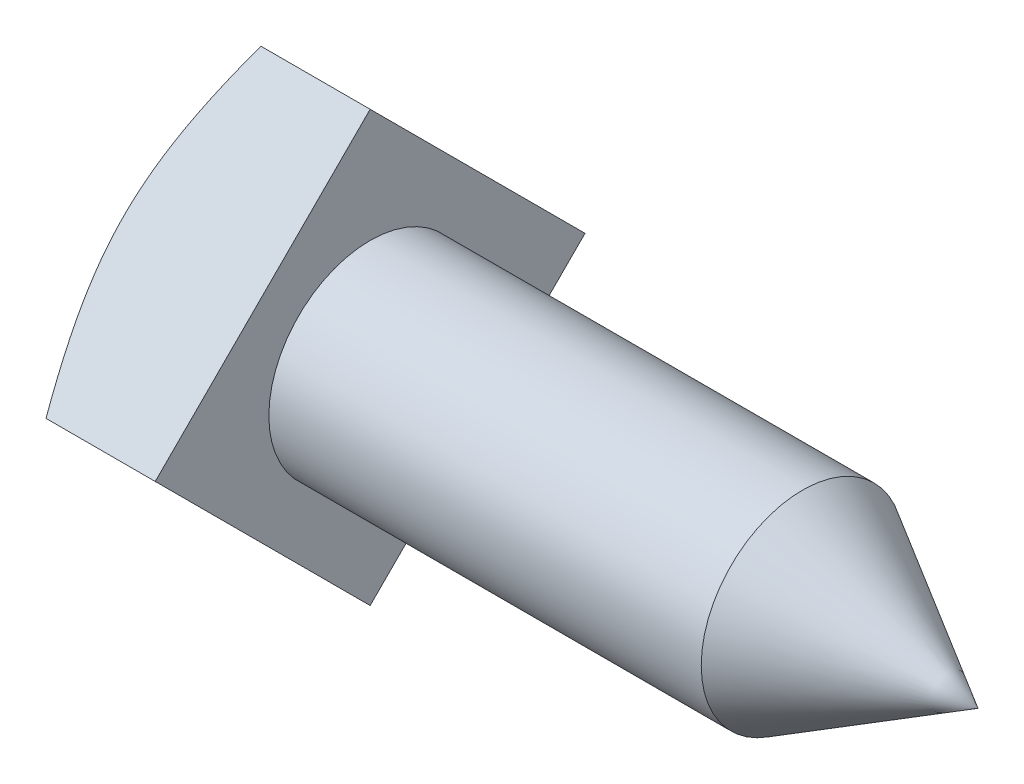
ISO-10303-21;
HEADER;
FILE_DESCRIPTION(('STEP AP214'),'2;1');
FILE_NAME('part.step','',(''),(''),'','','');
FILE_SCHEMA(('AUTOMOTIVE_DESIGN { 1 0 10303 214 1 1 1 1 }'));
ENDSEC;
DATA;
#1=APPLICATION_CONTEXT('core data for automotive mechanical design processes');
#2=APPLICATION_PROTOCOL_DEFINITION('international standard','automotive_design',2000,#1);
#3=PRODUCT_CONTEXT('',#1,'mechanical');
#4=PRODUCT('Part','Part','',(#3));
#5=PRODUCT_RELATED_PRODUCT_CATEGORY('part','',(#4));
#6=PRODUCT_DEFINITION_FORMATION('','',#4);
#7=PRODUCT_DEFINITION_CONTEXT('part definition',#1,'design');
#8=PRODUCT_DEFINITION('design','',#6,#7);
#9=PRODUCT_DEFINITION_SHAPE('','',#8);
#10=(LENGTH_UNIT() NAMED_UNIT(*) SI_UNIT(.MILLI.,.METRE.));
#11=(NAMED_UNIT(*) PLANE_ANGLE_UNIT() SI_UNIT($,.RADIAN.));
#12=(NAMED_UNIT(*) SI_UNIT($,.STERADIAN.) SOLID_ANGLE_UNIT());
#13=UNCERTAINTY_MEASURE_WITH_UNIT(LENGTH_MEASURE(1.E-05),#10,'distance_accuracy_value','');
#14=(GEOMETRIC_REPRESENTATION_CONTEXT(3) GLOBAL_UNCERTAINTY_ASSIGNED_CONTEXT((#13)) GLOBAL_UNIT_ASSIGNED_CONTEXT((#10,
#11,#12)) REPRESENTATION_CONTEXT('',''));
#15=CARTESIAN_POINT('',(0.,0.,0.));
#16=DIRECTION('',(0.,0.,1.));
#17=DIRECTION('',(1.,0.,0.));
#18=AXIS2_PLACEMENT_3D('',#15,#16,#17);
#19=CARTESIAN_POINT('',(17.3736,0.,-26.9407683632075));
#20=DIRECTION('',(0.,-0.707106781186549,0.707106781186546));
#21=DIRECTION('',(0.,-0.707106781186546,-0.707106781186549));
#22=AXIS2_PLACEMENT_3D('',#19,#20,#21);
#23=PLANE('',#22);
#24=CARTESIAN_POINT('',(3.67961897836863,26.9409683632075,0.000200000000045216));
#25=CARTESIAN_POINT('',(3.5548106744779,26.6733023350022,-0.267466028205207));
#26=CARTESIAN_POINT('',(3.43166591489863,26.4052457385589,-0.53552262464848));
#27=CARTESIAN_POINT('',(3.1890899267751,25.8682845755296,-1.0724837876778));
#28=CARTESIAN_POINT('',(3.06965881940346,25.599379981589,-1.34138838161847));
#29=CARTESIAN_POINT('',(2.83485734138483,25.0605646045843,-1.88020375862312));
#30=CARTESIAN_POINT('',(2.71948863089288,24.7906534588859,-2.15011490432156));
#31=CARTESIAN_POINT('',(2.49331484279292,24.2498808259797,-2.69088753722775));
#32=CARTESIAN_POINT('',(2.38250972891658,23.9790193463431,-2.96174901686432));
#33=CARTESIAN_POINT('',(2.05612530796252,23.1610744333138,-3.77969392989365));
#34=CARTESIAN_POINT('',(1.84824930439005,22.6124346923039,-4.32833367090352));
#35=CARTESIAN_POINT('',(1.45758123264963,21.5107337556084,-5.43003460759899));
#36=CARTESIAN_POINT('',(1.27478662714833,20.9576730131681,-5.9830953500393));
#37=CARTESIAN_POINT('',(0.945511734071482,19.8664326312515,-7.07433573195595));
#38=CARTESIAN_POINT('',(0.797980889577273,19.3284131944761,-7.61235516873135));
#39=CARTESIAN_POINT('',(0.536422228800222,18.2482773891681,-8.69249097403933));
#40=CARTESIAN_POINT('',(0.422394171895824,17.7061610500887,-9.23460731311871));
#41=CARTESIAN_POINT('',(0.233146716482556,16.6203771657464,-10.3203911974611));
#42=CARTESIAN_POINT('',(0.157794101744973,16.0767215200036,-10.8640468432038));
#43=CARTESIAN_POINT('',(0.0762638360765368,15.2597076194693,-11.6810607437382));
#44=CARTESIAN_POINT('',(0.0543365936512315,14.9871029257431,-11.9536654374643));
#45=CARTESIAN_POINT('',(0.0212582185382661,14.4415698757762,-12.4991984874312));
#46=CARTESIAN_POINT('',(0.0101066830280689,14.1686415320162,-12.7721268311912));
#47=CARTESIAN_POINT('',(-0.00161011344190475,13.605599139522,-13.3351692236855));
#48=CARTESIAN_POINT('',(-0.00146976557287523,13.3154776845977,-13.6252906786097));
#49=CARTESIAN_POINT('',(0.0111599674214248,12.7353688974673,-14.2053994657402));
#50=CARTESIAN_POINT('',(0.0236494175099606,12.4453815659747,-14.4953867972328));
#51=CARTESIAN_POINT('',(0.06078024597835,11.8657903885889,-15.0749779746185));
#52=CARTESIAN_POINT('',(0.085421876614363,11.5761865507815,-15.364581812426));
#53=CARTESIAN_POINT('',(0.146470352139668,10.9975953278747,-15.9431730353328));
#54=CARTESIAN_POINT('',(0.182877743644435,10.7086079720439,-16.2321603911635));
#55=CARTESIAN_POINT('',(0.309293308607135,9.84074831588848,-17.100020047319));
#56=CARTESIAN_POINT('',(0.416353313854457,9.26308735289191,-17.6776810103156));
#57=CARTESIAN_POINT('',(0.670258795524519,8.11225138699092,-18.8285169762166));
#58=CARTESIAN_POINT('',(0.817104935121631,7.53907645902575,-19.4016919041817));
#59=CARTESIAN_POINT('',(1.15063001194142,6.37560138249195,-20.5651669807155));
#60=CARTESIAN_POINT('',(1.33862518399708,5.78549181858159,-21.1552765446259));
#61=CARTESIAN_POINT('',(1.74416737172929,4.61034109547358,-22.3304272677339));
#62=CARTESIAN_POINT('',(1.96171822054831,4.0253006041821,-22.9154677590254));
#63=CARTESIAN_POINT('',(2.30502412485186,3.15351567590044,-23.7872526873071));
#64=CARTESIAN_POINT('',(2.42180887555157,2.86498021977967,-24.0757881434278));
#65=CARTESIAN_POINT('',(2.66065189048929,2.28899759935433,-24.6517707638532));
#66=CARTESIAN_POINT('',(2.78271020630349,2.00155044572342,-24.9392179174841));
#67=CARTESIAN_POINT('',(3.03148171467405,1.42782962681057,-25.5129387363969));
#68=CARTESIAN_POINT('',(3.15819248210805,1.14155543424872,-25.7992129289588));
#69=CARTESIAN_POINT('',(3.41584794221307,0.569973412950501,-26.370794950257));
#70=CARTESIAN_POINT('',(3.54679246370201,0.284665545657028,-26.6561028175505));
#71=CARTESIAN_POINT('',(3.67961897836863,-0.000199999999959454,-26.9409683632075));
#72=B_SPLINE_CURVE_WITH_KNOTS('',3,(#24,#25,#26,#27,#28,#29,#30,#31,#32,#33,#34,#35,#36,#37,#38,
#39,#40,#41,#42,#43,#44,#45,#46,#47,#48,#49,#50,#51,#52,#53,#54,#55,#56,#57,#58,#59,#60,#61,#62,
#63,#64,#65,#66,#67,#68,#69,#70,#71),.UNSPECIFIED.,.F.,.F.,(4,2,2,2,2,2,2,2,2,2,2,2,2,2,2,2,2,2,
2,2,2,2,2,4),(0.,1.19574621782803,2.39153141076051,3.5877997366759,4.78405855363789,
7.1934730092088,9.60264353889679,11.9271362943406,14.2516123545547,16.5680271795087,
17.726333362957,18.8845962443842,20.1152898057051,21.3459898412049,22.5767154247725,
23.8074981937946,26.2780083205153,28.7485596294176,31.3142561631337,33.8802857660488,
35.1535601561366,36.4268470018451,37.6994793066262,38.9720602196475),.UNSPECIFIED.);
#73=CARTESIAN_POINT('',(3.67952571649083,26.9407683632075,0.));
#74=VERTEX_POINT('',#73);
#75=CARTESIAN_POINT('',(0.,13.4703841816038,-13.4703841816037));
#76=VERTEX_POINT('',#75);
#77=EDGE_CURVE('E105',#74,#76,#72,.T.);
#78=ORIENTED_EDGE('',*,*,#77,.F.);
#79=DIRECTION('',(-1.,0.,0.));
#80=VECTOR('',#79,1.);
#81=CARTESIAN_POINT('',(17.3736,26.9407683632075,0.));
#82=LINE('',#81,#80);
#83=CARTESIAN_POINT('',(17.3736,26.9407683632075,0.));
#84=VERTEX_POINT('',#83);
#85=EDGE_CURVE('E115',#84,#74,#82,.T.);
#86=ORIENTED_EDGE('',*,*,#85,.F.);
#87=DIRECTION('',(0.,0.707106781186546,0.707106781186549));
#88=VECTOR('',#87,1.);
#89=CARTESIAN_POINT('',(17.3736,0.,-26.9407683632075));
#90=LINE('',#89,#88);
#91=CARTESIAN_POINT('',(17.3736,0.,-26.9407683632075));
#92=VERTEX_POINT('',#91);
#93=EDGE_CURVE('E118',#92,#84,#90,.T.);
#94=ORIENTED_EDGE('',*,*,#93,.F.);
#95=DIRECTION('',(-1.,0.,0.));
#96=VECTOR('',#95,1.);
#97=CARTESIAN_POINT('',(17.3736,0.,-26.9407683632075));
#98=LINE('',#97,#96);
#99=CARTESIAN_POINT('',(3.67952571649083,0.,-26.9407683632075));
#100=VERTEX_POINT('',#99);
#101=EDGE_CURVE('E181',#92,#100,#98,.T.);
#102=ORIENTED_EDGE('',*,*,#101,.T.);
#103=EDGE_CURVE('E54',#76,#100,#72,.T.);
#104=ORIENTED_EDGE('',*,*,#103,.F.);
#105=EDGE_LOOP('',(#78,#86,#94,#102,#104));
#106=FACE_BOUND('',#105,.T.);
#107=ADVANCED_FACE('F33',(#106),#23,.F.);
#108=CARTESIAN_POINT('',(17.3736,0.,26.9407683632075));
#109=DIRECTION('',(0.,0.707106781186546,0.707106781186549));
#110=DIRECTION('',(0.,-0.707106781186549,0.707106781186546));
#111=AXIS2_PLACEMENT_3D('',#108,#109,#110);
#112=PLANE('',#111);
#113=ORIENTED_EDGE('',*,*,#85,.T.);
#114=CARTESIAN_POINT('',(3.67961897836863,26.9409683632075,-0.000199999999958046));
#115=CARTESIAN_POINT('',(3.5548106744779,26.6733023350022,0.267466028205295));
#116=CARTESIAN_POINT('',(3.43166591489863,26.4052457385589,0.535522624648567));
#117=CARTESIAN_POINT('',(3.1890899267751,25.8682845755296,1.07248378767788));
#118=CARTESIAN_POINT('',(3.06965881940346,25.5993799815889,1.34138838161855));
#119=CARTESIAN_POINT('',(2.83485734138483,25.0605646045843,1.8802037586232));
#120=CARTESIAN_POINT('',(2.71948863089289,24.7906534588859,2.15011490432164));
#121=CARTESIAN_POINT('',(2.49331484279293,24.2498808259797,2.69088753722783));
#122=CARTESIAN_POINT('',(2.38250972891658,23.9790193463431,2.9617490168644));
#123=CARTESIAN_POINT('',(2.05612530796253,23.1610744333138,3.77969392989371));
#124=CARTESIAN_POINT('',(1.84824930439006,22.6124346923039,4.32833367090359));
#125=CARTESIAN_POINT('',(1.45758123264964,21.5107337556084,5.43003460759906));
#126=CARTESIAN_POINT('',(1.27478662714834,20.9576730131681,5.98309535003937));
#127=CARTESIAN_POINT('',(0.945511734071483,19.8664326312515,7.07433573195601));
#128=CARTESIAN_POINT('',(0.797980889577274,19.3284131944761,7.61235516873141));
#129=CARTESIAN_POINT('',(0.536422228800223,18.2482773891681,8.69249097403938));
#130=CARTESIAN_POINT('',(0.422394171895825,17.7061610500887,9.23460731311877));
#131=CARTESIAN_POINT('',(0.233146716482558,16.6203771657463,10.3203911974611));
#132=CARTESIAN_POINT('',(0.157794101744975,16.0767215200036,10.8640468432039));
#133=CARTESIAN_POINT('',(0.0762638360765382,15.2597076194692,11.6810607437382));
#134=CARTESIAN_POINT('',(0.0543365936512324,14.9871029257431,11.9536654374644));
#135=CARTESIAN_POINT('',(0.0212582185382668,14.4415698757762,12.4991984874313));
#136=CARTESIAN_POINT('',(0.01010668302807,14.1686415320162,12.7721268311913));
#137=CARTESIAN_POINT('',(-0.00161011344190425,13.6055991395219,13.3351692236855));
#138=CARTESIAN_POINT('',(-0.00146976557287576,13.3154776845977,13.6252906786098));
#139=CARTESIAN_POINT('',(0.0111599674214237,12.7353688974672,14.2053994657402));
#140=CARTESIAN_POINT('',(0.0236494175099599,12.4453815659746,14.4953867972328));
#141=CARTESIAN_POINT('',(0.0607802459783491,11.8657903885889,15.0749779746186));
#142=CARTESIAN_POINT('',(0.0854218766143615,11.5761865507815,15.364581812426));
#143=CARTESIAN_POINT('',(0.146470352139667,10.9975953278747,15.9431730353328));
#144=CARTESIAN_POINT('',(0.182877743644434,10.7086079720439,16.2321603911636));
#145=CARTESIAN_POINT('',(0.309293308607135,9.84074831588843,17.100020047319));
#146=CARTESIAN_POINT('',(0.416353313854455,9.26308735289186,17.6776810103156));
#147=CARTESIAN_POINT('',(0.670258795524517,8.11225138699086,18.8285169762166));
#148=CARTESIAN_POINT('',(0.817104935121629,7.53907645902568,19.4016919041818));
#149=CARTESIAN_POINT('',(1.15063001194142,6.37560138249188,20.5651669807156));
#150=CARTESIAN_POINT('',(1.33862518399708,5.78549181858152,21.1552765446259));
#151=CARTESIAN_POINT('',(1.74416737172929,4.6103410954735,22.3304272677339));
#152=CARTESIAN_POINT('',(1.96171822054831,4.02530060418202,22.9154677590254));
#153=CARTESIAN_POINT('',(2.30502412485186,3.15351567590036,23.7872526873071));
#154=CARTESIAN_POINT('',(2.42180887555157,2.86498021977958,24.0757881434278));
#155=CARTESIAN_POINT('',(2.66065189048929,2.28899759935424,24.6517707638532));
#156=CARTESIAN_POINT('',(2.7827102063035,2.00155044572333,24.9392179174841));
#157=CARTESIAN_POINT('',(3.03148171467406,1.42782962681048,25.5129387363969));
#158=CARTESIAN_POINT('',(3.15819248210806,1.14155543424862,25.7992129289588));
#159=CARTESIAN_POINT('',(3.41584794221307,0.569973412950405,26.370794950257));
#160=CARTESIAN_POINT('',(3.54679246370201,0.284665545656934,26.6561028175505));
#161=CARTESIAN_POINT('',(3.67961897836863,-0.00020000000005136,26.9409683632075));
#162=B_SPLINE_CURVE_WITH_KNOTS('',3,(#114,#115,#116,#117,#118,#119,#120,#121,#122,#123,#124,
#125,#126,#127,#128,#129,#130,#131,#132,#133,#134,#135,#136,#137,#138,#139,#140,#141,#142,#143,
#144,#145,#146,#147,#148,#149,#150,#151,#152,#153,#154,#155,#156,#157,#158,#159,#160,#161),
.UNSPECIFIED.,.F.,.F.,(4,2,2,2,2,2,2,2,2,2,2,2,2,2,2,2,2,2,2,2,2,2,2,4),(0.,1.19574621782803,
2.39153141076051,3.58779973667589,4.78405855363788,7.19347300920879,9.60264353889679,
11.9271362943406,14.2516123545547,16.5680271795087,17.726333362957,18.8845962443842,
20.1152898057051,21.3459898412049,22.5767154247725,23.8074981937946,26.2780083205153,
28.7485596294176,31.3142561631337,33.8802857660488,35.1535601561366,36.4268470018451,
37.6994793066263,38.9720602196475),.UNSPECIFIED.);
#163=CARTESIAN_POINT('',(0.,13.4703841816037,13.4703841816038));
#164=VERTEX_POINT('',#163);
#165=EDGE_CURVE('E98',#74,#164,#162,.T.);
#166=ORIENTED_EDGE('',*,*,#165,.T.);
#167=CARTESIAN_POINT('',(3.67952571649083,0.,26.9407683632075));
#168=VERTEX_POINT('',#167);
#169=EDGE_CURVE('E89',#164,#168,#162,.T.);
#170=ORIENTED_EDGE('',*,*,#169,.T.);
#171=DIRECTION('',(-1.,0.,0.));
#172=VECTOR('',#171,1.);
#173=CARTESIAN_POINT('',(17.3736,0.,26.9407683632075));
#174=LINE('',#173,#172);
#175=CARTESIAN_POINT('',(17.3736,0.,26.9407683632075));
#176=VERTEX_POINT('',#175);
#177=EDGE_CURVE('E188',#176,#168,#174,.T.);
#178=ORIENTED_EDGE('',*,*,#177,.F.);
#179=DIRECTION('',(0.,0.707106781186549,-0.707106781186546));
#180=VECTOR('',#179,1.);
#181=CARTESIAN_POINT('',(17.3736,0.,26.9407683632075));
#182=LINE('',#181,#180);
#183=EDGE_CURVE('E203',#176,#84,#182,.T.);
#184=ORIENTED_EDGE('',*,*,#183,.T.);
#185=EDGE_LOOP('',(#113,#166,#170,#178,#184));
#186=FACE_BOUND('',#185,.T.);
#187=ADVANCED_FACE('F112',(#186),#112,.T.);
#188=CARTESIAN_POINT('',(17.3736,0.,26.9407683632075));
#189=DIRECTION('',(0.,0.707106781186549,-0.707106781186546));
#190=DIRECTION('',(0.,0.707106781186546,0.707106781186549));
#191=AXIS2_PLACEMENT_3D('',#188,#189,#190);
#192=PLANE('',#191);
#193=CARTESIAN_POINT('',(3.67961897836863,-26.9409683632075,-0.000200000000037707));
#194=CARTESIAN_POINT('',(3.5548106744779,-26.6733023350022,0.267466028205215));
#195=CARTESIAN_POINT('',(3.43166591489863,-26.4052457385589,0.535522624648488));
#196=CARTESIAN_POINT('',(3.1890899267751,-25.8682845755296,1.07248378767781));
#197=CARTESIAN_POINT('',(3.06965881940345,-25.5993799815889,1.34138838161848));
#198=CARTESIAN_POINT('',(2.83485734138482,-25.0605646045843,1.88020375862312));
#199=CARTESIAN_POINT('',(2.71948863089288,-24.7906534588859,2.15011490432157));
#200=CARTESIAN_POINT('',(2.49331484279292,-24.2498808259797,2.69088753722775));
#201=CARTESIAN_POINT('',(2.38250972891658,-23.9790193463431,2.96174901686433));
#202=CARTESIAN_POINT('',(2.05612530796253,-23.1610744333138,3.77969392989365));
#203=CARTESIAN_POINT('',(1.84824930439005,-22.6124346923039,4.32833367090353));
#204=CARTESIAN_POINT('',(1.45758123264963,-21.5107337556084,5.430034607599));
#205=CARTESIAN_POINT('',(1.27478662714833,-20.9576730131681,5.98309535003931));
#206=CARTESIAN_POINT('',(0.945511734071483,-19.8664326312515,7.07433573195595));
#207=CARTESIAN_POINT('',(0.797980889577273,-19.3284131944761,7.61235516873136));
#208=CARTESIAN_POINT('',(0.536422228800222,-18.2482773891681,8.69249097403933));
#209=CARTESIAN_POINT('',(0.422394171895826,-17.7061610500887,9.23460731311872));
#210=CARTESIAN_POINT('',(0.233146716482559,-16.6203771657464,10.3203911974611));
#211=CARTESIAN_POINT('',(0.157794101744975,-16.0767215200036,10.8640468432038));
#212=CARTESIAN_POINT('',(0.0762638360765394,-15.2597076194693,11.6810607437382));
#213=CARTESIAN_POINT('',(0.0543365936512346,-14.9871029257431,11.9536654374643));
#214=CARTESIAN_POINT('',(0.0212582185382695,-14.4415698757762,12.4991984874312));
#215=CARTESIAN_POINT('',(0.0101066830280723,-14.1686415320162,12.7721268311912));
#216=CARTESIAN_POINT('',(-0.0016101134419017,-13.6055991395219,13.3351692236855));
#217=CARTESIAN_POINT('',(-0.00146976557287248,-13.3154776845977,13.6252906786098));
#218=CARTESIAN_POINT('',(0.0111599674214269,-12.7353688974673,14.2053994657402));
#219=CARTESIAN_POINT('',(0.0236494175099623,-12.4453815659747,14.4953867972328));
#220=CARTESIAN_POINT('',(0.0607802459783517,-11.8657903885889,15.0749779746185));
#221=CARTESIAN_POINT('',(0.0854218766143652,-11.5761865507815,15.364581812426));
#222=CARTESIAN_POINT('',(0.146470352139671,-10.9975953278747,15.9431730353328));
#223=CARTESIAN_POINT('',(0.182877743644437,-10.7086079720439,16.2321603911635));
#224=CARTESIAN_POINT('',(0.309293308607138,-9.84074831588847,17.100020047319));
#225=CARTESIAN_POINT('',(0.416353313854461,-9.26308735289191,17.6776810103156));
#226=CARTESIAN_POINT('',(0.670258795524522,-8.11225138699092,18.8285169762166));
#227=CARTESIAN_POINT('',(0.817104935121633,-7.53907645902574,19.4016919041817));
#228=CARTESIAN_POINT('',(1.15063001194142,-6.37560138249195,20.5651669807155));
#229=CARTESIAN_POINT('',(1.33862518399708,-5.78549181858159,21.1552765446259));
#230=CARTESIAN_POINT('',(1.74416737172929,-4.61034109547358,22.3304272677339));
#231=CARTESIAN_POINT('',(1.96171822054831,-4.0253006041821,22.9154677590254));
#232=CARTESIAN_POINT('',(2.30502412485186,-3.15351567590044,23.7872526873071));
#233=CARTESIAN_POINT('',(2.42180887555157,-2.86498021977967,24.0757881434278));
#234=CARTESIAN_POINT('',(2.66065189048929,-2.28899759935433,24.6517707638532));
#235=CARTESIAN_POINT('',(2.78271020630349,-2.00155044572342,24.9392179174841));
#236=CARTESIAN_POINT('',(3.03148171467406,-1.42782962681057,25.5129387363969));
#237=CARTESIAN_POINT('',(3.15819248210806,-1.14155543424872,25.7992129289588));
#238=CARTESIAN_POINT('',(3.41584794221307,-0.569973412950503,26.370794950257));
#239=CARTESIAN_POINT('',(3.54679246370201,-0.284665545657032,26.6561028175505));
#240=CARTESIAN_POINT('',(3.67961897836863,0.00019999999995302,26.9409683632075));
#241=B_SPLINE_CURVE_WITH_KNOTS('',3,(#193,#194,#195,#196,#197,#198,#199,#200,#201,#202,#203,
#204,#205,#206,#207,#208,#209,#210,#211,#212,#213,#214,#215,#216,#217,#218,#219,#220,#221,#222,
#223,#224,#225,#226,#227,#228,#229,#230,#231,#232,#233,#234,#235,#236,#237,#238,#239,#240),
.UNSPECIFIED.,.F.,.F.,(4,2,2,2,2,2,2,2,2,2,2,2,2,2,2,2,2,2,2,2,2,2,2,4),(0.,1.19574621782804,
2.39153141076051,3.5877997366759,4.78405855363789,7.1934730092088,9.60264353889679,
11.9271362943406,14.2516123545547,16.5680271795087,17.726333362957,18.8845962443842,
20.1152898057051,21.3459898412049,22.5767154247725,23.8074981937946,26.2780083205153,
28.7485596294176,31.3142561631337,33.8802857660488,35.1535601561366,36.4268470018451,
37.6994793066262,38.9720602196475),.UNSPECIFIED.);
#242=CARTESIAN_POINT('',(3.67952571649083,-26.9407683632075,0.));
#243=VERTEX_POINT('',#242);
#244=CARTESIAN_POINT('',(0.,-13.4703841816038,13.4703841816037));
#245=VERTEX_POINT('',#244);
#246=EDGE_CURVE('E146',#243,#245,#241,.T.);
#247=ORIENTED_EDGE('',*,*,#246,.F.);
#248=DIRECTION('',(-1.,0.,0.));
#249=VECTOR('',#248,1.);
#250=CARTESIAN_POINT('',(17.3736,-26.9407683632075,0.));
#251=LINE('',#250,#249);
#252=CARTESIAN_POINT('',(17.3736,-26.9407683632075,0.));
#253=VERTEX_POINT('',#252);
#254=EDGE_CURVE('E184',#253,#243,#251,.T.);
#255=ORIENTED_EDGE('',*,*,#254,.F.);
#256=DIRECTION('',(0.,-0.707106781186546,-0.707106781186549));
#257=VECTOR('',#256,1.);
#258=CARTESIAN_POINT('',(17.3736,0.,26.9407683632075));
#259=LINE('',#258,#257);
#260=EDGE_CURVE('E190',#176,#253,#259,.T.);
#261=ORIENTED_EDGE('',*,*,#260,.F.);
#262=ORIENTED_EDGE('',*,*,#177,.T.);
#263=EDGE_CURVE('E94',#245,#168,#241,.T.);
#264=ORIENTED_EDGE('',*,*,#263,.F.);
#265=EDGE_LOOP('',(#247,#255,#261,#262,#264));
#266=FACE_BOUND('',#265,.T.);
#267=ADVANCED_FACE('F151',(#266),#192,.F.);
#268=CARTESIAN_POINT('',(17.3736,0.,-26.9407683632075));
#269=DIRECTION('',(0.,-0.707106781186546,-0.707106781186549));
#270=DIRECTION('',(0.,0.707106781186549,-0.707106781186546));
#271=AXIS2_PLACEMENT_3D('',#268,#269,#270);
#272=PLANE('',#271);
#273=ORIENTED_EDGE('',*,*,#254,.T.);
#274=CARTESIAN_POINT('',(3.67961897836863,-26.9409683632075,0.000199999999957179));
#275=CARTESIAN_POINT('',(3.5548106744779,-26.6733023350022,-0.267466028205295));
#276=CARTESIAN_POINT('',(3.43166591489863,-26.4052457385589,-0.535522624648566));
#277=CARTESIAN_POINT('',(3.1890899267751,-25.8682845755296,-1.07248378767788));
#278=CARTESIAN_POINT('',(3.06965881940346,-25.5993799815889,-1.34138838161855));
#279=CARTESIAN_POINT('',(2.83485734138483,-25.0605646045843,-1.8802037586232));
#280=CARTESIAN_POINT('',(2.71948863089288,-24.7906534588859,-2.15011490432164));
#281=CARTESIAN_POINT('',(2.49331484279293,-24.2498808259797,-2.69088753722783));
#282=CARTESIAN_POINT('',(2.38250972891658,-23.9790193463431,-2.9617490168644));
#283=CARTESIAN_POINT('',(2.05612530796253,-23.1610744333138,-3.77969392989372));
#284=CARTESIAN_POINT('',(1.84824930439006,-22.6124346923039,-4.32833367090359));
#285=CARTESIAN_POINT('',(1.45758123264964,-21.5107337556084,-5.43003460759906));
#286=CARTESIAN_POINT('',(1.27478662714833,-20.9576730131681,-5.98309535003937));
#287=CARTESIAN_POINT('',(0.945511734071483,-19.8664326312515,-7.07433573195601));
#288=CARTESIAN_POINT('',(0.797980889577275,-19.3284131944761,-7.61235516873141));
#289=CARTESIAN_POINT('',(0.536422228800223,-18.2482773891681,-8.69249097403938));
#290=CARTESIAN_POINT('',(0.422394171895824,-17.7061610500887,-9.23460731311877));
#291=CARTESIAN_POINT('',(0.233146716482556,-16.6203771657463,-10.3203911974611));
#292=CARTESIAN_POINT('',(0.157794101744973,-16.0767215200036,-10.8640468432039));
#293=CARTESIAN_POINT('',(0.0762638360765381,-15.2597076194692,-11.6810607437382));
#294=CARTESIAN_POINT('',(0.0543365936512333,-14.9871029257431,-11.9536654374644));
#295=CARTESIAN_POINT('',(0.0212582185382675,-14.4415698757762,-12.4991984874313));
#296=CARTESIAN_POINT('',(0.0101066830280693,-14.1686415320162,-12.7721268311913));
#297=CARTESIAN_POINT('',(-0.00161011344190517,-13.6055991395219,-13.3351692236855));
#298=CARTESIAN_POINT('',(-0.00146976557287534,-13.3154776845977,-13.6252906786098));
#299=CARTESIAN_POINT('',(0.0111599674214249,-12.7353688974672,-14.2053994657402));
#300=CARTESIAN_POINT('',(0.0236494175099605,-12.4453815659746,-14.4953867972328));
#301=CARTESIAN_POINT('',(0.06078024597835,-11.8657903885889,-15.0749779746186));
#302=CARTESIAN_POINT('',(0.0854218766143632,-11.5761865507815,-15.364581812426));
#303=CARTESIAN_POINT('',(0.146470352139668,-10.9975953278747,-15.9431730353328));
#304=CARTESIAN_POINT('',(0.182877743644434,-10.7086079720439,-16.2321603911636));
#305=CARTESIAN_POINT('',(0.309293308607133,-9.84074831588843,-17.100020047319));
#306=CARTESIAN_POINT('',(0.416353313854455,-9.26308735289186,-17.6776810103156));
#307=CARTESIAN_POINT('',(0.670258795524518,-8.11225138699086,-18.8285169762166));
#308=CARTESIAN_POINT('',(0.817104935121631,-7.53907645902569,-19.4016919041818));
#309=CARTESIAN_POINT('',(1.15063001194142,-6.37560138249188,-20.5651669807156));
#310=CARTESIAN_POINT('',(1.33862518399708,-5.78549181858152,-21.1552765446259));
#311=CARTESIAN_POINT('',(1.74416737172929,-4.61034109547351,-22.3304272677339));
#312=CARTESIAN_POINT('',(1.96171822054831,-4.02530060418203,-22.9154677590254));
#313=CARTESIAN_POINT('',(2.30502412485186,-3.15351567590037,-23.7872526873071));
#314=CARTESIAN_POINT('',(2.42180887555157,-2.86498021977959,-24.0757881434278));
#315=CARTESIAN_POINT('',(2.66065189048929,-2.28899759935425,-24.6517707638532));
#316=CARTESIAN_POINT('',(2.78271020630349,-2.00155044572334,-24.9392179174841));
#317=CARTESIAN_POINT('',(3.03148171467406,-1.42782962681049,-25.5129387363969));
#318=CARTESIAN_POINT('',(3.15819248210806,-1.14155543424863,-25.7992129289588));
#319=CARTESIAN_POINT('',(3.41584794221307,-0.569973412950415,-26.370794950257));
#320=CARTESIAN_POINT('',(3.54679246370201,-0.284665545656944,-26.6561028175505));
#321=CARTESIAN_POINT('',(3.67961897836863,0.000200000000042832,-26.9409683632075));
#322=B_SPLINE_CURVE_WITH_KNOTS('',3,(#274,#275,#276,#277,#278,#279,#280,#281,#282,#283,#284,
#285,#286,#287,#288,#289,#290,#291,#292,#293,#294,#295,#296,#297,#298,#299,#300,#301,#302,#303,
#304,#305,#306,#307,#308,#309,#310,#311,#312,#313,#314,#315,#316,#317,#318,#319,#320,#321),
.UNSPECIFIED.,.F.,.F.,(4,2,2,2,2,2,2,2,2,2,2,2,2,2,2,2,2,2,2,2,2,2,2,4),(0.,1.19574621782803,
2.39153141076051,3.5877997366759,4.78405855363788,7.19347300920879,9.60264353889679,
11.9271362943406,14.2516123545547,16.5680271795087,17.726333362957,18.8845962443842,
20.1152898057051,21.3459898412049,22.5767154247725,23.8074981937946,26.2780083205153,
28.7485596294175,31.3142561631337,33.8802857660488,35.1535601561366,36.4268470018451,
37.6994793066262,38.9720602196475),.UNSPECIFIED.);
#323=CARTESIAN_POINT('',(0.,-13.4703841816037,-13.4703841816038));
#324=VERTEX_POINT('',#323);
#325=EDGE_CURVE('E150',#243,#324,#322,.T.);
#326=ORIENTED_EDGE('',*,*,#325,.T.);
#327=EDGE_CURVE('E108',#324,#100,#322,.T.);
#328=ORIENTED_EDGE('',*,*,#327,.T.);
#329=ORIENTED_EDGE('',*,*,#101,.F.);
#330=DIRECTION('',(0.,-0.707106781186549,0.707106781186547));
#331=VECTOR('',#330,1.);
#332=CARTESIAN_POINT('',(17.3736,0.,-26.9407683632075));
#333=LINE('',#332,#331);
#334=EDGE_CURVE('E185',#92,#253,#333,.T.);
#335=ORIENTED_EDGE('',*,*,#334,.T.);
#336=EDGE_LOOP('',(#273,#326,#328,#329,#335));
#337=FACE_BOUND('',#336,.T.);
#338=ADVANCED_FACE('F154',(#337),#272,.T.);
#339=CARTESIAN_POINT('',(17.3736,0.,-26.9407683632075));
#340=DIRECTION('',(1.,0.,0.));
#341=DIRECTION('',(0.,0.,-1.));
#342=AXIS2_PLACEMENT_3D('',#339,#340,#341);
#343=PLANE('',#342);
#344=CARTESIAN_POINT('',(17.3736,0.,0.));
#345=DIRECTION('',(1.,0.,0.));
#346=DIRECTION('',(0.,0.,-1.));
#347=AXIS2_PLACEMENT_3D('',#344,#345,#346);
#348=CIRCLE('',#347,12.7);
#349=CARTESIAN_POINT('',(17.3736,0.,-12.7));
#350=VERTEX_POINT('',#349);
#351=EDGE_CURVE('E195',#350,#350,#348,.T.);
#352=ORIENTED_EDGE('',*,*,#351,.F.);
#353=EDGE_LOOP('',(#352));
#354=FACE_BOUND('',#353,.T.);
#355=ORIENTED_EDGE('',*,*,#93,.T.);
#356=ORIENTED_EDGE('',*,*,#183,.F.);
#357=ORIENTED_EDGE('',*,*,#260,.T.);
#358=ORIENTED_EDGE('',*,*,#334,.F.);
#359=EDGE_LOOP('',(#355,#356,#357,#358));
#360=FACE_BOUND('',#359,.T.);
#361=ADVANCED_FACE('F159',(#354,#360),#343,.T.);
#362=CARTESIAN_POINT('',(0.,0.,0.));
#363=DIRECTION('',(-1.,0.,0.));
#364=DIRECTION('',(0.,0.,1.));
#365=AXIS2_PLACEMENT_3D('',#362,#363,#364);
#366=CYLINDRICAL_SURFACE('',#365,12.7);
#367=CARTESIAN_POINT('',(71.5765547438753,0.,0.));
#368=DIRECTION('',(-1.,0.,0.));
#369=DIRECTION('',(0.,0.,1.));
#370=AXIS2_PLACEMENT_3D('',#367,#368,#369);
#371=CIRCLE('',#370,12.7);
#372=CARTESIAN_POINT('',(71.5765547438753,0.,12.7));
#373=VERTEX_POINT('',#372);
#374=EDGE_CURVE('E116',#373,#373,#371,.T.);
#375=ORIENTED_EDGE('',*,*,#374,.T.);
#376=EDGE_LOOP('',(#375));
#377=FACE_BOUND('',#376,.T.);
#378=ORIENTED_EDGE('',*,*,#351,.T.);
#379=EDGE_LOOP('',(#378));
#380=FACE_BOUND('',#379,.T.);
#381=ADVANCED_FACE('F164',(#377,#380),#366,.T.);
#382=CARTESIAN_POINT('',(71.5765547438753,0.,0.));
#383=DIRECTION('',(-1.,0.,0.));
#384=DIRECTION('',(0.,0.,1.));
#385=AXIS2_PLACEMENT_3D('',#382,#383,#384);
#386=CONICAL_SURFACE('',#385,12.7,0.5235987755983);
#387=CARTESIAN_POINT('',(93.5736,0.,0.));
#388=VERTEX_POINT('',#387);
#389=VERTEX_LOOP('',#388);
#390=FACE_BOUND('',#389,.T.);
#391=ORIENTED_EDGE('',*,*,#374,.F.);
#392=EDGE_LOOP('',(#391));
#393=FACE_BOUND('',#392,.T.);
#394=ADVANCED_FACE('F136',(#390,#393),#386,.T.);
#395=CARTESIAN_POINT('',(0.,0.,0.));
#396=DIRECTION('',(1.,0.,0.));
#397=DIRECTION('',(0.,0.,-1.));
#398=AXIS2_PLACEMENT_3D('',#395,#396,#397);
#399=CONICAL_SURFACE('',#398,19.05,1.13446401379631);
#400=ORIENTED_EDGE('',*,*,#103,.T.);
#401=ORIENTED_EDGE('',*,*,#327,.F.);
#402=CARTESIAN_POINT('',(0.,0.,0.));
#403=DIRECTION('',(1.,0.,0.));
#404=DIRECTION('',(0.,0.,-1.));
#405=AXIS2_PLACEMENT_3D('',#402,#403,#404);
#406=CIRCLE('',#405,19.05);
#407=EDGE_CURVE('E37',#76,#324,#406,.F.);
#408=ORIENTED_EDGE('',*,*,#407,.F.);
#409=EDGE_LOOP('',(#400,#401,#408));
#410=FACE_BOUND('',#409,.T.);
#411=ADVANCED_FACE('F171',(#410),#399,.T.);
#412=ORIENTED_EDGE('',*,*,#77,.T.);
#413=CARTESIAN_POINT('',(0.,0.,0.));
#414=DIRECTION('',(-1.,0.,0.));
#415=DIRECTION('',(0.,0.,1.));
#416=AXIS2_PLACEMENT_3D('',#413,#414,#415);
#417=CIRCLE('',#416,19.05);
#418=EDGE_CURVE('E102',#164,#76,#417,.T.);
#419=ORIENTED_EDGE('',*,*,#418,.F.);
#420=ORIENTED_EDGE('',*,*,#165,.F.);
#421=EDGE_LOOP('',(#412,#419,#420));
#422=FACE_BOUND('',#421,.T.);
#423=ADVANCED_FACE('F103',(#422),#399,.T.);
#424=EDGE_CURVE('E42',#245,#164,#406,.F.);
#425=ORIENTED_EDGE('',*,*,#424,.F.);
#426=ORIENTED_EDGE('',*,*,#263,.T.);
#427=ORIENTED_EDGE('',*,*,#169,.F.);
#428=EDGE_LOOP('',(#425,#426,#427));
#429=FACE_BOUND('',#428,.T.);
#430=ADVANCED_FACE('F91',(#429),#399,.T.);
#431=ORIENTED_EDGE('',*,*,#246,.T.);
#432=EDGE_CURVE('E11',#324,#245,#406,.F.);
#433=ORIENTED_EDGE('',*,*,#432,.F.);
#434=ORIENTED_EDGE('',*,*,#325,.F.);
#435=EDGE_LOOP('',(#431,#433,#434));
#436=FACE_BOUND('',#435,.T.);
#437=ADVANCED_FACE('F135',(#436),#399,.T.);
#438=CARTESIAN_POINT('',(0.,0.,-26.9407683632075));
#439=DIRECTION('',(1.,0.,0.));
#440=DIRECTION('',(0.,0.,-1.));
#441=AXIS2_PLACEMENT_3D('',#438,#439,#440);
#442=PLANE('',#441);
#443=ORIENTED_EDGE('',*,*,#407,.T.);
#444=ORIENTED_EDGE('',*,*,#432,.T.);
#445=ORIENTED_EDGE('',*,*,#424,.T.);
#446=ORIENTED_EDGE('',*,*,#418,.T.);
#447=EDGE_LOOP('',(#443,#444,#445,#446));
#448=FACE_BOUND('',#447,.T.);
#449=ADVANCED_FACE('F110',(#448),#442,.F.);
#450=CLOSED_SHELL('',(#107,#187,#267,#338,#361,#381,#394,#411,#423,#430,#437,#449));
#451=MANIFOLD_SOLID_BREP('B2',#450);
#452=ADVANCED_BREP_SHAPE_REPRESENTATION('',(#18,#451),#14);
#453=SHAPE_DEFINITION_REPRESENTATION(#9,#452);
ENDSEC;
END-ISO-10303-21;
